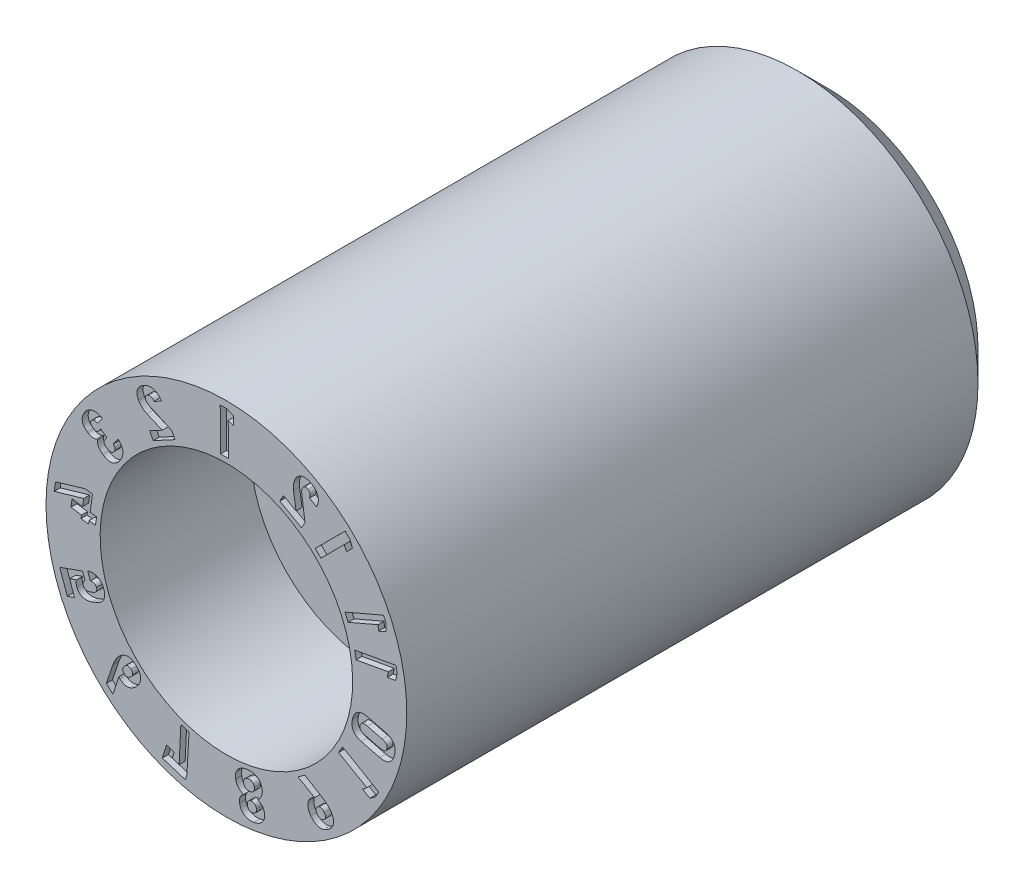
from build123d import *

# Parameters (mm, degrees)
CUT_EXTRUDE1_DEPTH = 0.1


with BuildPart() as part:
    # Sketch1 → Revolve1 (revolve)
    with BuildSketch(Plane(origin=(0, 0, 0), x_dir=(0, 0, -1), z_dir=(1, 0, 0)), mode=Mode.PRIVATE) as revolve1_sk:
        Polygon((10, 0.8), (10, 2.5), (9.5, 3), (0, 3), (0, 2.1), (2.5, 2.1), (2.5, 0.8), align=None)
    revolve(revolve1_sk.sketch.rotate(Axis((0, 0, 0), (0, 0, -1)), 180), axis=Axis((0, 0, 0), (0, 0, -1)))

    # Sketch2 → Cut-Extrude1 (cut)
    # profile 1 of 15: a face of its own
    with BuildSketch(Plane.XY):
        Polygon((-0.098720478, 2.183361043), (0.033456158, 2.18410041), (0.030635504, 2.730707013), (0.116357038, 2.698664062), (0.115654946, 2.839287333), (0.010584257, 2.885948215), (-0.102281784, 2.885328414), align=None)
    # profile 2 of 15: a face of its own
    with BuildSketch(Plane.XY):
        with BuildLine():
            Line((-0.909098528, 2.115845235), (-1.270014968, 2.279834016))
            add(Edge.make_bspline(
                [(-1.270014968, 2.279834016), (-1.285183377, 2.286827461), (-1.303513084, 2.297164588), (-1.321424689, 2.313703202), (-1.331285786, 2.324078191), (-1.337237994, 2.332679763), (-1.34046237, 2.338587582)],
                knots=[0, 0, 0, 0, 0.540031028, 0.66553244, 0.783527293, 1, 1, 1, 1], degree=3))
            add(Edge.make_bspline(
                [(-1.34046237, 2.338587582), (-1.345191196, 2.346859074), (-1.349282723, 2.358912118), (-1.349080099, 2.375373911), (-1.34593905, 2.38686971), (-1.340065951, 2.397752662), (-1.328125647, 2.411955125), (-1.315859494, 2.419934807), (-1.307070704, 2.424732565)],
                knots=[0, 0, 0, 0, 0.246786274, 0.356909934, 0.46944845, 0.586307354, 0.710253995, 1, 1, 1, 1], degree=3))
            add(Edge.make_bspline(
                [(-1.307070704, 2.424732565), (-1.298254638, 2.429437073), (-1.283992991, 2.434470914), (-1.264274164, 2.434539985), (-1.250034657, 2.431328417), (-1.236301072, 2.425121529), (-1.217968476, 2.412442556), (-1.206702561, 2.399086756), (-1.199905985, 2.389271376)],
                knots=[0, 0, 0, 0, 0.240300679, 0.353786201, 0.468512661, 0.587496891, 0.71289196, 1, 1, 1, 1], degree=3))
            Line((-1.199905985, 2.389271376), (-1.080740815, 2.452863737))
            add(Edge.make_bspline(
                [(-1.080740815, 2.452863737), (-1.091852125, 2.470709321), (-1.110121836, 2.494775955), (-1.13894901, 2.521479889), (-1.161443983, 2.537524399), (-1.185017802, 2.550216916), (-1.209502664, 2.559421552), (-1.234868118, 2.56462525), (-1.260823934, 2.566464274), (-1.287247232, 2.564674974), (-1.323430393, 2.556885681), (-1.349667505, 2.546235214), (-1.366473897, 2.53703459)],
                knots=[0, 0, 0, 0, 0.185247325, 0.270908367, 0.35379884, 0.433963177, 0.511943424, 0.589014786, 0.666847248, 0.746166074, 0.827198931, 1, 1, 1, 1], degree=3))
            add(Edge.make_bspline(
                [(-1.366473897, 2.53703459), (-1.384304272, 2.527354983), (-1.409307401, 2.511340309), (-1.437802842, 2.485684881), (-1.454939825, 2.465742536), (-1.468681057, 2.444841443), (-1.478807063, 2.422955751), (-1.485462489, 2.400219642), (-1.488089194, 2.376638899), (-1.487354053, 2.352479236), (-1.480773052, 2.318756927), (-1.470657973, 2.294302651), (-1.462098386, 2.278504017)],
                knots=[0, 0, 0, 0, 0.194582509, 0.283014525, 0.366623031, 0.445927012, 0.521986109, 0.596944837, 0.671952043, 0.748457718, 0.827747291, 1, 1, 1, 1], degree=3))
            add(Edge.make_bspline(
                [(-1.462098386, 2.278504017), (-1.454227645, 2.264109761), (-1.441177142, 2.243880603), (-1.420009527, 2.219623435), (-1.402682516, 2.202363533), (-1.383956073, 2.186555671), (-1.35741098, 2.168042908), (-1.336191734, 2.156382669), (-1.321424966, 2.150036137)],
                knots=[0, 0, 0, 0, 0.24663637, 0.371530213, 0.498650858, 0.625608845, 0.751024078, 1, 1, 1, 1], degree=3))
            Line((-1.321424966, 2.150036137), (-1.066700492, 2.040346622))
            Line((-1.066700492, 2.040346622), (-1.277167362, 1.926913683))
            Line((-1.277167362, 1.926913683), (-1.216935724, 1.815090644))
            Line((-1.216935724, 1.815090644), (-0.852820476, 2.011242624))
            Line((-0.852820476, 2.011242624), (-0.909098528, 2.115845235))
        make_face()
    # profile 3 of 15: a face of its own
    with BuildSketch(Plane.XY):
        with BuildLine():
            Line((-1.801883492, 1.544980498), (-1.880006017, 1.43385943))
            add(Edge.make_bspline(
                [(-1.880006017, 1.43385943), (-1.87487862, 1.429308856), (-1.868086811, 1.421837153), (-1.860996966, 1.410811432), (-1.856895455, 1.402559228), (-1.854247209, 1.3940888), (-1.85252689, 1.38557761), (-1.852072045, 1.37699943), (-1.852601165, 1.368357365), (-1.854488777, 1.359803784), (-1.8583708, 1.348138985), (-1.863371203, 1.340103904), (-1.866839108, 1.334788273)],
                knots=[0, 0, 0, 0, 0.185947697, 0.272003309, 0.355057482, 0.435080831, 0.512072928, 0.590042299, 0.667454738, 0.746220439, 0.82700958, 1, 1, 1, 1], degree=3))
            add(Edge.make_bspline(
                [(-1.866839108, 1.334788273), (-1.873178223, 1.325537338), (-1.884411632, 1.313429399), (-1.902828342, 1.302947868), (-1.917078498, 1.298987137), (-1.931923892, 1.298289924), (-1.953029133, 1.302259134), (-1.967701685, 1.310347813), (-1.97703908, 1.31673151)],
                knots=[0, 0, 0, 0, 0.265501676, 0.382853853, 0.496663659, 0.611874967, 0.731229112, 1, 1, 1, 1], degree=3))
            Line((-1.97703908, 1.31673151), (-1.990372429, 1.326052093))
            add(Edge.make_bspline(
                [(-1.990372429, 1.326052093), (-1.999848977, 1.333083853), (-2.013496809, 1.343714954), (-2.025737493, 1.361652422), (-2.031598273, 1.374526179), (-2.034274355, 1.387715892), (-2.032931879, 1.405850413), (-2.027186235, 1.418607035), (-2.021608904, 1.426083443)],
                knots=[0, 0, 0, 0, 0.300615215, 0.428560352, 0.545417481, 0.656048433, 0.764757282, 1, 1, 1, 1], degree=3))
            Line((-2.021608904, 1.426083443), (-1.987644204, 1.474290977))
            Line((-1.987644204, 1.474290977), (-2.091297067, 1.547206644))
            Line((-2.091297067, 1.547206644), (-2.125261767, 1.498999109))
            add(Edge.make_bspline(
                [(-2.125261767, 1.498999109), (-2.129461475, 1.49262222), (-2.137924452, 1.484861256), (-2.151872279, 1.479097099), (-2.163256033, 1.47786373), (-2.175428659, 1.478828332), (-2.193267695, 1.484488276), (-2.206151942, 1.491513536), (-2.214435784, 1.497553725)],
                knots=[0, 0, 0, 0, 0.226652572, 0.333129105, 0.444988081, 0.564971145, 0.694921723, 1, 1, 1, 1], degree=3))
            Line((-2.214435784, 1.497553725), (-2.224150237, 1.504381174))
            add(Edge.make_bspline(
                [(-2.224150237, 1.504381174), (-2.231925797, 1.509976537), (-2.242700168, 1.519001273), (-2.252270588, 1.534005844), (-2.256502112, 1.545122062), (-2.257906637, 1.556563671), (-2.256464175, 1.572471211), (-2.250509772, 1.583455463), (-2.245918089, 1.590224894)],
                knots=[0, 0, 0, 0, 0.287811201, 0.411477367, 0.527914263, 0.639876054, 0.752930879, 1, 1, 1, 1], degree=3))
            add(Edge.make_bspline(
                [(-2.245918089, 1.590224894), (-2.242607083, 1.594914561), (-2.236845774, 1.6014217), (-2.227352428, 1.607787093), (-2.219822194, 1.611738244), (-2.211638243, 1.614680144), (-2.202886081, 1.616398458), (-2.193590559, 1.617056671), (-2.18386769, 1.616803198), (-2.173733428, 1.615322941), (-2.15932377, 1.611916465), (-2.148708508, 1.607590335), (-2.14158886, 1.604363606)],
                knots=[0, 0, 0, 0, 0.150181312, 0.223296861, 0.297155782, 0.371585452, 0.449302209, 0.52905163, 0.614285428, 0.702508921, 0.795752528, 1, 1, 1, 1], degree=3))
            Line((-2.14158886, 1.604363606), (-2.063773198, 1.715071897))
            add(Edge.make_bspline(
                [(-2.063773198, 1.715071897), (-2.081248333, 1.725217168), (-2.108368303, 1.737622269), (-2.14599919, 1.747445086), (-2.173334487, 1.750835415), (-2.200112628, 1.750925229), (-2.226050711, 1.747485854), (-2.250939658, 1.740533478), (-2.274718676, 1.730366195), (-2.297037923, 1.716989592), (-2.325229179, 1.695251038), (-2.342768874, 1.674601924), (-2.353244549, 1.659856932)],
                knots=[0, 0, 0, 0, 0.185487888, 0.271925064, 0.356056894, 0.437650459, 0.51709444, 0.595429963, 0.674142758, 0.753752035, 0.833670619, 1, 1, 1, 1], degree=3))
            add(Edge.make_bspline(
                [(-2.353244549, 1.659856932), (-2.361796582, 1.64799191), (-2.372736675, 1.629611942), (-2.384516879, 1.60441102), (-2.391052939, 1.586165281), (-2.395609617, 1.568116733), (-2.398086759, 1.550254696), (-2.39865307, 1.532640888), (-2.397130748, 1.515325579), (-2.39392962, 1.498396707), (-2.388440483, 1.482094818), (-2.381277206, 1.466266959), (-2.37218256, 1.450999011), (-2.360976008, 1.436445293), (-2.342960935, 1.417467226), (-2.32760687, 1.404478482), (-2.316246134, 1.39674606)],
                knots=[0, 0, 0, 0, 0.145024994, 0.211773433, 0.275829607, 0.33708983, 0.396197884, 0.454480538, 0.511605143, 0.568407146, 0.625059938, 0.681891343, 0.740573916, 0.801023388, 0.86380105, 1, 1, 1, 1], degree=3))
            Line((-2.316246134, 1.39674606), (-2.299015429, 1.384577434))
            add(Edge.make_bspline(
                [(-2.299015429, 1.384577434), (-2.286442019, 1.376020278), (-2.266469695, 1.364783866), (-2.237435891, 1.357699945), (-2.215827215, 1.355422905), (-2.194139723, 1.35676088), (-2.165045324, 1.363515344), (-2.144565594, 1.373609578), (-2.131738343, 1.381993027)],
                knots=[0, 0, 0, 0, 0.256766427, 0.378902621, 0.5000938, 0.620743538, 0.742279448, 1, 1, 1, 1], degree=3))
            add(Edge.make_bspline(
                [(-2.131738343, 1.381993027), (-2.135009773, 1.374313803), (-2.138503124, 1.362462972), (-2.141321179, 1.346437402), (-2.142113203, 1.334574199), (-2.141599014, 1.3227474), (-2.140234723, 1.310947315), (-2.13730727, 1.299279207), (-2.132195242, 1.283644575), (-2.122651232, 1.264537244), (-2.100992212, 1.234755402), (-2.079355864, 1.215986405), (-2.063356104, 1.204800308)],
                knots=[0, 0, 0, 0, 0.120941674, 0.178737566, 0.235932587, 0.293131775, 0.35041005, 0.40804081, 0.467422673, 0.589011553, 0.716165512, 1, 1, 1, 1], degree=3))
            Line((-2.063356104, 1.204800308), (-2.045991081, 1.192679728))
            add(Edge.make_bspline(
                [(-2.045991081, 1.192679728), (-2.030330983, 1.182031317), (-2.006328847, 1.167678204), (-1.971978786, 1.156440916), (-1.947194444, 1.151756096), (-1.922643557, 1.151045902), (-1.898606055, 1.154169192), (-1.875036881, 1.160844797), (-1.852264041, 1.1716141), (-1.830145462, 1.185815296), (-1.801006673, 1.210402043), (-1.782348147, 1.233301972), (-1.770636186, 1.249662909)],
                knots=[0, 0, 0, 0, 0.178299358, 0.259714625, 0.338098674, 0.414262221, 0.489195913, 0.564778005, 0.643203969, 0.72472314, 0.810857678, 1, 1, 1, 1], degree=3))
            add(Edge.make_bspline(
                [(-1.770636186, 1.249662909), (-1.759102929, 1.266092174), (-1.74414016, 1.291714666), (-1.730625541, 1.327993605), (-1.723986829, 1.354740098), (-1.721156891, 1.381433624), (-1.721493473, 1.407775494), (-1.725987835, 1.433510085), (-1.733635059, 1.458646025), (-1.74515969, 1.482723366), (-1.766077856, 1.513511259), (-1.786625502, 1.533300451), (-1.801883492, 1.544980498)],
                knots=[0, 0, 0, 0, 0.181472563, 0.266227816, 0.349030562, 0.429720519, 0.508099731, 0.586210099, 0.664894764, 0.744781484, 0.826358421, 1, 1, 1, 1], degree=3))
        make_face()
    # profile 4 of 15: a face of its own
    with BuildSketch(Plane.XY):
        Polygon((-2.346366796, 0.556911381), (-2.843020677, 0.40892151), (-2.863791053, 0.261124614), (-2.373786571, 0.404048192), (-2.391588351, 0.277639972), (-2.56712748, 0.302390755), (-2.585641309, 0.171756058), (-2.409987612, 0.14698912), (-2.417640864, 0.092644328), (-2.291825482, 0.074920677), (-2.284166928, 0.129248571), (-2.177397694, 0.114194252), (-2.158883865, 0.244828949), (-2.265749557, 0.259896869), (-2.226272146, 0.539939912), align=None)
    # profile 5 of 15: a face of its own
    with BuildSketch(Plane.XY):
        with BuildLine():
            Line((-2.307233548, -0.60438587), (-2.263150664, -0.729175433))
            add(Edge.make_bspline(
                [(-2.263150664, -0.729175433), (-2.251377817, -0.726141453), (-2.234344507, -0.723644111), (-2.212524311, -0.726198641), (-2.198187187, -0.730522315), (-2.185600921, -0.737514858), (-2.170980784, -0.750226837), (-2.163998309, -0.763355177), (-2.160560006, -0.772475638)],
                knots=[0, 0, 0, 0, 0.285979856, 0.41291731, 0.532388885, 0.648288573, 0.760985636, 1, 1, 1, 1], degree=3))
            add(Edge.make_bspline(
                [(-2.160560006, -0.772475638), (-2.157176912, -0.782326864), (-2.153751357, -0.797843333), (-2.157623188, -0.817807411), (-2.163482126, -0.831313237), (-2.172841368, -0.8434212), (-2.189938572, -0.858644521), (-2.206436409, -0.866138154), (-2.217988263, -0.870396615)],
                knots=[0, 0, 0, 0, 0.245537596, 0.357255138, 0.469313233, 0.585744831, 0.711147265, 1, 1, 1, 1], degree=3))
            Line((-2.217988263, -0.870396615), (-2.273510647, -0.890140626))
            add(Edge.make_bspline(
                [(-2.273510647, -0.890140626), (-2.285083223, -0.894275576), (-2.302260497, -0.898817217), (-2.324790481, -0.898989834), (-2.339182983, -0.896006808), (-2.351935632, -0.890541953), (-2.36642434, -0.879038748), (-2.37356739, -0.866792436), (-2.376612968, -0.857940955)],
                knots=[0, 0, 0, 0, 0.302844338, 0.431574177, 0.550434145, 0.661796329, 0.76957872, 1, 1, 1, 1], degree=3))
            add(Edge.make_bspline(
                [(-2.376612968, -0.857940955), (-2.379604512, -0.849558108), (-2.382537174, -0.836648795), (-2.382109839, -0.819389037), (-2.379664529, -0.807255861), (-2.375219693, -0.795769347), (-2.366577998, -0.781415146), (-2.357286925, -0.772584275), (-2.350456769, -0.767510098)],
                knots=[0, 0, 0, 0, 0.263342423, 0.385862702, 0.507647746, 0.627191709, 0.748065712, 1, 1, 1, 1], degree=3))
            Line((-2.350456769, -0.767510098), (-2.392047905, -0.651183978))
            Line((-2.392047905, -0.651183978), (-2.772130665, -0.786810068))
            Line((-2.772130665, -0.786810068), (-2.645335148, -1.141872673))
            Line((-2.645335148, -1.141872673), (-2.525233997, -1.099040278))
            Line((-2.525233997, -1.099040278), (-2.607524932, -0.868607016))
            Line((-2.607524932, -0.868607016), (-2.490777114, -0.82685566))
            add(Edge.make_bspline(
                [(-2.490777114, -0.82685566), (-2.49394469, -0.833524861), (-2.496743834, -0.844617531), (-2.498627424, -0.860252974), (-2.498859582, -0.886118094), (-2.494910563, -0.907827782), (-2.489257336, -0.924336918)],
                knots=[0, 0, 0, 0, 0.221259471, 0.34293735, 0.47419753, 1, 1, 1, 1], degree=3))
            add(Edge.make_bspline(
                [(-2.489257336, -0.924336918), (-2.483531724, -0.940369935), (-2.472446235, -0.962972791), (-2.452020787, -0.988595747), (-2.434556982, -1.004133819), (-2.415160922, -1.016893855), (-2.393590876, -1.026325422), (-2.37008561, -1.032336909), (-2.344788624, -1.035395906), (-2.317831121, -1.034945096), (-2.278429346, -1.03055616), (-2.248901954, -1.021685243), (-2.229006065, -1.014769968)],
                knots=[0, 0, 0, 0, 0.16365674, 0.239510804, 0.313508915, 0.387354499, 0.46174098, 0.538606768, 0.619722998, 0.705857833, 0.797118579, 1, 1, 1, 1], degree=3))
            Line((-2.229006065, -1.014769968), (-2.173483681, -0.995025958))
            add(Edge.make_bspline(
                [(-2.173483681, -0.995025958), (-2.15357459, -0.987921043), (-2.125327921, -0.975129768), (-2.092397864, -0.95226371), (-2.071928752, -0.933559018), (-2.054870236, -0.913083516), (-2.041499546, -0.890801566), (-2.031828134, -0.866841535), (-2.025784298, -0.841336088), (-2.023691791, -0.814434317), (-2.025934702, -0.775754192), (-2.033564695, -0.746761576), (-2.040346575, -0.727525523)],
                knots=[0, 0, 0, 0, 0.186939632, 0.272046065, 0.353268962, 0.431220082, 0.506711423, 0.581925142, 0.658650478, 0.737395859, 0.819503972, 1, 1, 1, 1], degree=3))
            add(Edge.make_bspline(
                [(-2.040346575, -0.727525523), (-2.046188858, -0.710429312), (-2.058159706, -0.686374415), (-2.079354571, -0.658084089), (-2.097480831, -0.639744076), (-2.117791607, -0.624016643), (-2.140312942, -0.611682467), (-2.16453337, -0.601967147), (-2.190652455, -0.595682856), (-2.21827195, -0.592599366), (-2.257699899, -0.59324521), (-2.287470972, -0.598758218), (-2.307233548, -0.60438587)],
                knots=[0, 0, 0, 0, 0.165351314, 0.244287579, 0.323078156, 0.400981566, 0.478830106, 0.557643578, 0.63948441, 0.724229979, 0.811685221, 1, 1, 1, 1], degree=3))
        make_face()
    # profile 6 of 15: a face of its own
    with BuildSketch(Plane.XY):
        with BuildLine():
            Line((-1.889555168, -1.75439237), (-1.995138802, -2.070022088))
            Line((-1.995138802, -2.070022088), (-1.887249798, -2.173115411))
            Line((-1.887249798, -2.173115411), (-1.789330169, -1.87100414))
            add(Edge.make_bspline(
                [(-1.789330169, -1.87100414), (-1.784440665, -1.877950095), (-1.778712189, -1.884315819), (-1.772623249, -1.890207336)],
                knots=[0.75991926, 0.75991926, 0.75991926, 0.75991926, 1, 1, 1, 1], degree=3))
            add(Edge.make_bspline(
                [(-1.772623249, -1.890207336), (-1.759601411, -1.902634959), (-1.738724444, -1.919069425), (-1.707734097, -1.933968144), (-1.684626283, -1.941262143), (-1.661036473, -1.944568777), (-1.637190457, -1.944477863), (-1.613290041, -1.940185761), (-1.589307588, -1.932493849), (-1.565541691, -1.920949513), (-1.532847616, -1.900391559), (-1.510793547, -1.880080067), (-1.496572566, -1.865343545)],
                knots=[0, 0, 0, 0, 0.171910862, 0.250610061, 0.326760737, 0.401984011, 0.476838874, 0.553147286, 0.632553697, 0.716253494, 0.804371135, 1, 1, 1, 1], degree=3))
            add(Edge.make_bspline(
                [(-1.496572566, -1.865343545), (-1.481622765, -1.85014492), (-1.462532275, -1.826047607), (-1.443272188, -1.791218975), (-1.433401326, -1.765533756), (-1.427161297, -1.739773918), (-1.425382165, -1.714036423), (-1.427328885, -1.688497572), (-1.433460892, -1.663326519), (-1.443364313, -1.638550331), (-1.4626649, -1.605456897), (-1.482096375, -1.583135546), (-1.496638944, -1.569183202)],
                knots=[0, 0, 0, 0, 0.187278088, 0.272506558, 0.353965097, 0.431955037, 0.507955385, 0.583051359, 0.659476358, 0.73805999, 0.820178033, 1, 1, 1, 1], degree=3))
            add(Edge.make_bspline(
                [(-1.496638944, -1.569183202), (-1.511075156, -1.555256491), (-1.534215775, -1.536912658), (-1.568088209, -1.519190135), (-1.593219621, -1.510142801), (-1.618595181, -1.505262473), (-1.644013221, -1.504199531), (-1.669414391, -1.507091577), (-1.694714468, -1.514027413), (-1.719586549, -1.52507634), (-1.753399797, -1.545202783), (-1.775894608, -1.565796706), (-1.790432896, -1.580566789)],
                knots=[0, 0, 0, 0, 0.180176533, 0.262990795, 0.342264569, 0.419092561, 0.494073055, 0.569806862, 0.647689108, 0.728633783, 0.813435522, 1, 1, 1, 1], degree=3))
            add(Edge.make_bspline(
                [(-1.790432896, -1.580566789), (-1.799795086, -1.590255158), (-1.81256956, -1.605552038), (-1.828327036, -1.627489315), (-1.851803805, -1.664362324), (-1.867935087, -1.697687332), (-1.878868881, -1.72535116)],
                knots=[0, 0, 0, 0, 0.23012337, 0.350638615, 0.475698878, 1, 1, 1, 1], degree=3))
            add(Edge.make_bspline(
                [(-1.878868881, -1.72535116), (-1.880807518, -1.730188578), (-1.884872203, -1.73968918), (-1.887855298, -1.74958136), (-1.889555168, -1.75439237)],
                knots=[0, 0, 0, 0, 0.505360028, 1, 1, 1, 1], degree=3))
        make_face()
        with BuildLine():
            add(Edge.make_bspline(
                [(-1.58446489, -1.660961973), (-1.576878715, -1.668197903), (-1.566966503, -1.68030344), (-1.560358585, -1.699200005), (-1.559032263, -1.71322572), (-1.5608835, -1.727359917), (-1.568083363, -1.746977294), (-1.57800407, -1.759998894), (-1.585782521, -1.767977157)],
                knots=[0, 0, 0, 0, 0.259879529, 0.375972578, 0.488654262, 0.604088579, 0.724463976, 1, 1, 1, 1], degree=3))
            add(Edge.make_bspline(
                [(-1.585782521, -1.767977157), (-1.595125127, -1.777630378), (-1.609077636, -1.790168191), (-1.630525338, -1.800199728), (-1.645643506, -1.804116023), (-1.660631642, -1.804200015), (-1.680571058, -1.799470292), (-1.693597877, -1.790304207), (-1.701198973, -1.783031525)],
                knots=[0, 0, 0, 0, 0.29446835, 0.419975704, 0.537202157, 0.647939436, 0.758506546, 1, 1, 1, 1], degree=3))
            add(Edge.make_bspline(
                [(-1.701198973, -1.783031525), (-1.708832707, -1.775869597), (-1.718397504, -1.763222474), (-1.723721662, -1.74342167), (-1.724048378, -1.728380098), (-1.720882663, -1.712957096), (-1.711445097, -1.691271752), (-1.700070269, -1.676542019), (-1.691133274, -1.667339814)],
                knots=[0, 0, 0, 0, 0.240160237, 0.350244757, 0.463156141, 0.580574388, 0.706813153, 1, 1, 1, 1], degree=3))
            add(Edge.make_bspline(
                [(-1.691133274, -1.667339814), (-1.683151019, -1.65896935), (-1.670579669, -1.648595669), (-1.651426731, -1.640334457), (-1.637402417, -1.637996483), (-1.623400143, -1.638720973), (-1.604500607, -1.644815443), (-1.591924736, -1.653657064), (-1.58446489, -1.660961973)],
                knots=[0, 0, 0, 0, 0.277061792, 0.397428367, 0.512562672, 0.626259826, 0.74139413, 1, 1, 1, 1], degree=3))
        make_face(mode=Mode.SUBTRACT)
    # profile 7 of 15: a face of its own
    with BuildSketch(Plane.XY):
        Polygon((-0.656910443, -2.717648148), (-0.621111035, -2.085762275), (-0.75755319, -2.042458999), (-0.785917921, -2.635211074), (-0.900624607, -2.598733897), (-0.86869984, -2.498108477), (-0.99463076, -2.458228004), (-1.065078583, -2.68015205), (-0.683448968, -2.801286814), align=None)
    # profile 8 of 15: a face of its own
    with BuildSketch(Plane.XY):
        with BuildLine():
            Line((0.15402425, -2.365748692), (0.155823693, -2.37716977))
            add(Edge.make_bspline(
                [(0.155823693, -2.37716977), (0.158453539, -2.394221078), (0.166390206, -2.419117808), (0.183362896, -2.449647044), (0.199706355, -2.470633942), (0.218346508, -2.489709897), (0.24660379, -2.510888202), (0.270589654, -2.522167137), (0.287386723, -2.527201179)],
                knots=[0, 0, 0, 0, 0.245950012, 0.369874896, 0.49730233, 0.62492344, 0.749887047, 1, 1, 1, 1], degree=3))
            add(Edge.make_bspline(
                [(0.287386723, -2.527201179), (0.275169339, -2.535813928), (0.258421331, -2.550942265), (0.24088397, -2.57516334), (0.230320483, -2.59475192), (0.222467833, -2.615250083), (0.216226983, -2.643095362), (0.216427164, -2.664453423), (0.218695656, -2.678293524)],
                knots=[0, 0, 0, 0, 0.25672613, 0.38363542, 0.511859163, 0.637851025, 0.759401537, 1, 1, 1, 1], degree=3))
            Line((0.218695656, -2.678293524), (0.221503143, -2.696440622))
            add(Edge.make_bspline(
                [(0.221503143, -2.696440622), (0.224278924, -2.713608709), (0.231279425, -2.738573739), (0.247242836, -2.768530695), (0.261878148, -2.788315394), (0.279135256, -2.805586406), (0.298863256, -2.820003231), (0.32062779, -2.8320291), (0.344740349, -2.840837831), (0.370584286, -2.846983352), (0.408079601, -2.850520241), (0.436893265, -2.848962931), (0.456239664, -2.845616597)],
                knots=[0, 0, 0, 0, 0.166884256, 0.246053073, 0.324355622, 0.40205567, 0.479238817, 0.557958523, 0.639715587, 0.724648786, 0.812018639, 1, 1, 1, 1], degree=3))
            add(Edge.make_bspline(
                [(0.456239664, -2.845616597), (0.475525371, -2.842319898), (0.503706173, -2.835589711), (0.537940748, -2.819980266), (0.560646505, -2.806272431), (0.580639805, -2.790269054), (0.59786071, -2.772215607), (0.611943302, -2.752178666), (0.623007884, -2.730384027), (0.630630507, -2.70707225), (0.636695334, -2.673707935), (0.635251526, -2.647799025), (0.632621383, -2.630622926)],
                knots=[0, 0, 0, 0, 0.188034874, 0.275676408, 0.359981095, 0.44181779, 0.520591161, 0.598494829, 0.675898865, 0.754168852, 0.832942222, 1, 1, 1, 1], degree=3))
            Line((0.632621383, -2.630622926), (0.629813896, -2.612475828))
            add(Edge.make_bspline(
                [(0.629813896, -2.612475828), (0.627769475, -2.598359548), (0.620924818, -2.57788996), (0.606156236, -2.553103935), (0.591974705, -2.536206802), (0.575611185, -2.521081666), (0.551316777, -2.503552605), (0.530315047, -2.494976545), (0.515945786, -2.490716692)],
                knots=[0, 0, 0, 0, 0.24262632, 0.364099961, 0.490538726, 0.617681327, 0.743637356, 1, 1, 1, 1], degree=3))
            add(Edge.make_bspline(
                [(0.515945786, -2.490716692), (0.530641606, -2.480685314), (0.549823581, -2.462084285), (0.570484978, -2.433114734), (0.582496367, -2.409215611), (0.591552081, -2.384178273), (0.598755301, -2.349993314), (0.598259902, -2.323789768), (0.595472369, -2.3067857)],
                knots=[0, 0, 0, 0, 0.252226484, 0.37699801, 0.504744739, 0.631563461, 0.754934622, 1, 1, 1, 1], degree=3))
            Line((0.595472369, -2.3067857), (0.593672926, -2.295364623))
            add(Edge.make_bspline(
                [(0.593672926, -2.295364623), (0.590963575, -2.277042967), (0.583289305, -2.250618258), (0.566399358, -2.218825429), (0.550750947, -2.19797344), (0.532340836, -2.17976148), (0.511566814, -2.16404827), (0.487937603, -2.15194478), (0.462308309, -2.14242158), (0.434622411, -2.136277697), (0.39457444, -2.132061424), (0.363678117, -2.134461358), (0.342958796, -2.13777292)],
                knots=[0, 0, 0, 0, 0.166554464, 0.245225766, 0.322916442, 0.40024906, 0.47767046, 0.556368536, 0.638319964, 0.723174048, 0.810916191, 1, 1, 1, 1], degree=3))
            add(Edge.make_bspline(
                [(0.342958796, -2.13777292), (0.322326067, -2.141328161), (0.29210764, -2.148312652), (0.25547311, -2.165005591), (0.231139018, -2.179474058), (0.209747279, -2.196473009), (0.191222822, -2.21541458), (0.176173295, -2.236711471), (0.164358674, -2.259825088), (0.156016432, -2.284546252), (0.149964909, -2.320023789), (0.150942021, -2.347472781), (0.15402425, -2.365748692)],
                knots=[0, 0, 0, 0, 0.188976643, 0.276820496, 0.361568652, 0.443246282, 0.522147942, 0.59929835, 0.677100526, 0.755105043, 0.833250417, 1, 1, 1, 1], degree=3))
        make_face()
        with BuildLine():
            Line((0.466058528, -2.335179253), (0.467066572, -2.341905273))
            add(Edge.make_bspline(
                [(0.467066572, -2.341905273), (0.468120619, -2.349299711), (0.468826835, -2.360486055), (0.466156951, -2.37490175), (0.462672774, -2.384919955), (0.457802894, -2.394244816), (0.451792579, -2.402921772), (0.444251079, -2.410644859), (0.435572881, -2.417546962), (0.425746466, -2.423440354), (0.410957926, -2.43019933), (0.398770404, -2.433062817), (0.390421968, -2.434498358)],
                knots=[0, 0, 0, 0, 0.166389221, 0.245774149, 0.32412705, 0.401036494, 0.47875356, 0.557638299, 0.639825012, 0.724352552, 0.811459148, 1, 1, 1, 1], degree=3))
            add(Edge.make_bspline(
                [(0.390421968, -2.434498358), (0.382020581, -2.435720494), (0.369543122, -2.436849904), (0.35332663, -2.435072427), (0.342191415, -2.432482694), (0.331756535, -2.428684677), (0.322386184, -2.423385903), (0.313753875, -2.417173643), (0.306181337, -2.409689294), (0.299739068, -2.4011346), (0.292886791, -2.388157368), (0.289699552, -2.377461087), (0.288617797, -2.370038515)],
                knots=[0, 0, 0, 0, 0.1884736, 0.275197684, 0.360268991, 0.441190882, 0.520184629, 0.597925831, 0.676115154, 0.755045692, 0.834172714, 1, 1, 1, 1], degree=3))
            Line((0.288617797, -2.370038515), (0.287476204, -2.362905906))
            add(Edge.make_bspline(
                [(0.287476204, -2.362905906), (0.286210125, -2.35487403), (0.285686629, -2.342882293), (0.287968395, -2.327291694), (0.291367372, -2.316505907), (0.29597198, -2.306278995), (0.302137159, -2.297095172), (0.309575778, -2.288795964), (0.31826962, -2.281524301), (0.328026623, -2.27507128), (0.342874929, -2.268336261), (0.354808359, -2.264858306), (0.363157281, -2.26372233)],
                knots=[0, 0, 0, 0, 0.173777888, 0.254717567, 0.335682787, 0.414820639, 0.493742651, 0.571176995, 0.652365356, 0.735479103, 0.820480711, 1, 1, 1, 1], degree=3))
            add(Edge.make_bspline(
                [(0.363157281, -2.26372233), (0.371494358, -2.262303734), (0.383969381, -2.261704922), (0.400168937, -2.263725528), (0.411402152, -2.266821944), (0.421876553, -2.271254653), (0.43165422, -2.276686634), (0.440170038, -2.28392407), (0.44783027, -2.292123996), (0.454367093, -2.301504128), (0.4616588, -2.315503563), (0.464805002, -2.327179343), (0.466058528, -2.335179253)],
                knots=[0, 0, 0, 0, 0.18005291, 0.26436873, 0.347011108, 0.427480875, 0.506430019, 0.584318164, 0.664589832, 0.745065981, 0.827209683, 1, 1, 1, 1], degree=3))
        make_face(mode=Mode.SUBTRACT)
        with BuildLine():
            Line((0.498290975, -2.62804849), (0.499299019, -2.634774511))
            add(Edge.make_bspline(
                [(0.499299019, -2.634774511), (0.500263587, -2.641646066), (0.501132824, -2.651958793), (0.498997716, -2.665277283), (0.496369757, -2.6745306), (0.492626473, -2.683269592), (0.487413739, -2.691083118), (0.481331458, -2.698318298), (0.474025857, -2.70454837), (0.465843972, -2.709997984), (0.453358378, -2.715903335), (0.443078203, -2.7184492), (0.43604118, -2.719667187)],
                knots=[0, 0, 0, 0, 0.175248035, 0.257090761, 0.338037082, 0.416806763, 0.495075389, 0.573435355, 0.653849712, 0.735674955, 0.820090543, 1, 1, 1, 1], degree=3))
            add(Edge.make_bspline(
                [(0.43604118, -2.719667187), (0.428998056, -2.720669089), (0.41840988, -2.721682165), (0.404776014, -2.719584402), (0.395237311, -2.717313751), (0.386423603, -2.713462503), (0.37834067, -2.708613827), (0.371019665, -2.702640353), (0.364659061, -2.695495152), (0.359093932, -2.687447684), (0.353345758, -2.675087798), (0.350485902, -2.665116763), (0.349471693, -2.658161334)],
                knots=[0, 0, 0, 0, 0.179111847, 0.262746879, 0.344693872, 0.424028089, 0.502580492, 0.58023367, 0.659692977, 0.741501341, 0.824386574, 1, 1, 1, 1], degree=3))
            Line((0.349471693, -2.658161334), (0.3483301, -2.651028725))
            add(Edge.make_bspline(
                [(0.3483301, -2.651028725), (0.347010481, -2.643822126), (0.346574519, -2.633008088), (0.348124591, -2.61891207), (0.350907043, -2.609129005), (0.354575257, -2.599911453), (0.359484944, -2.591432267), (0.365766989, -2.584008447), (0.372851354, -2.57721879), (0.381088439, -2.571567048), (0.393447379, -2.565246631), (0.403672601, -2.562354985), (0.410752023, -2.561305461)],
                knots=[0, 0, 0, 0, 0.17820891, 0.262813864, 0.344874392, 0.425545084, 0.504461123, 0.582683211, 0.662100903, 0.743229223, 0.825445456, 1, 1, 1, 1], degree=3))
            add(Edge.make_bspline(
                [(0.410752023, -2.561305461), (0.41783279, -2.56003639), (0.428455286, -2.559646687), (0.442196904, -2.56168821), (0.451738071, -2.5645862), (0.460598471, -2.568736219), (0.46877519, -2.574011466), (0.47619028, -2.58043894), (0.482584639, -2.588207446), (0.488158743, -2.596857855), (0.494221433, -2.609984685), (0.497287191, -2.620603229), (0.498290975, -2.62804849)],
                knots=[0, 0, 0, 0, 0.17383815, 0.255176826, 0.335334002, 0.414325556, 0.491269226, 0.570235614, 0.650821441, 0.734020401, 0.818687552, 1, 1, 1, 1], degree=3))
        make_face(mode=Mode.SUBTRACT)
    # profile 9 of 15: a face of its own
    with BuildSketch(Plane.XY):
        with BuildLine():
            Line((1.580014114, -1.910742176), (1.303672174, -1.74211754))
            Line((1.303672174, -1.74211754), (1.191272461, -1.823730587))
            Line((1.191272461, -1.823730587), (1.466692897, -1.985341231))
            add(Edge.make_bspline(
                [(1.466692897, -1.985341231), (1.466036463, -1.985560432), (1.460942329, -1.987306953), (1.446345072, -1.993282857), (1.433660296, -2.001593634), (1.425177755, -2.007488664)],
                knots=[0.563271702, 0.563271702, 0.563271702, 0.563271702, 0.582456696, 0.712545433, 1, 1, 1, 1], degree=3))
            add(Edge.make_bspline(
                [(1.425177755, -2.007488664), (1.411813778, -2.017393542), (1.39329394, -2.034066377), (1.374928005, -2.061004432), (1.364444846, -2.082306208), (1.357498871, -2.104907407), (1.353544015, -2.128363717), (1.353350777, -2.152647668), (1.356359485, -2.177506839), (1.362913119, -2.202608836), (1.375985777, -2.237024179), (1.390863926, -2.261148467), (1.401990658, -2.27674116)],
                knots=[0, 0, 0, 0, 0.164686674, 0.242999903, 0.32077056, 0.398262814, 0.475705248, 0.554875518, 0.637235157, 0.72230948, 0.81046721, 1, 1, 1, 1], degree=3))
            add(Edge.make_bspline(
                [(1.401990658, -2.27674116), (1.414817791, -2.293949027), (1.434594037, -2.317587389), (1.465631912, -2.342429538), (1.488882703, -2.356977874), (1.513084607, -2.367449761), (1.53784871, -2.374063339), (1.563231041, -2.376691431), (1.589043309, -2.37523091), (1.61513957, -2.369752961), (1.651109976, -2.356761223), (1.676594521, -2.341812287), (1.692832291, -2.329914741)],
                knots=[0, 0, 0, 0, 0.187674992, 0.273075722, 0.35439933, 0.43207934, 0.507842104, 0.582607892, 0.659159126, 0.73796091, 0.820071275, 1, 1, 1, 1], degree=3))
            add(Edge.make_bspline(
                [(1.692832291, -2.329914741), (1.709090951, -2.318252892), (1.731162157, -2.298791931), (1.75447012, -2.268620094), (1.767566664, -2.245335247), (1.776688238, -2.220991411), (1.782076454, -2.195851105), (1.783249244, -2.169964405), (1.780656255, -2.143472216), (1.774210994, -2.116485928), (1.759440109, -2.079223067), (1.743754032, -2.052542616), (1.731094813, -2.035566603)],
                knots=[0, 0, 0, 0, 0.17804964, 0.259654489, 0.338129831, 0.414765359, 0.490064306, 0.565893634, 0.644318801, 0.726149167, 0.811832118, 1, 1, 1, 1], degree=3))
            add(Edge.make_bspline(
                [(1.731094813, -2.035566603), (1.723805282, -2.025325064), (1.711618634, -2.011164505), (1.693491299, -1.993298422), (1.678165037, -1.979800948), (1.661550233, -1.966277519), (1.636950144, -1.947911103), (1.61757332, -1.934500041), (1.604071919, -1.92577962)],
                knots=[0, 0, 0, 0, 0.216626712, 0.332172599, 0.453193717, 0.580305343, 0.713713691, 1, 1, 1, 1], degree=3))
            add(Edge.make_bspline(
                [(1.604071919, -1.92577962), (1.600102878, -1.923121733), (1.592090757, -1.918095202), (1.584268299, -1.912753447), (1.580014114, -1.910742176)],
                knots=[0, 0, 0, 0, 0.504712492, 1, 1, 1, 1], degree=3))
        make_face()
        with BuildLine():
            add(Edge.make_bspline(
                [(1.519403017, -2.090839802), (1.527778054, -2.08469599), (1.541643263, -2.077416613), (1.56171989, -2.075222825), (1.576196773, -2.077128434), (1.590441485, -2.082189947), (1.609318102, -2.094466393), (1.621187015, -2.107511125), (1.628215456, -2.117430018)],
                knots=[0, 0, 0, 0, 0.246692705, 0.358778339, 0.471983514, 0.588823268, 0.712749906, 1, 1, 1, 1], degree=3))
            add(Edge.make_bspline(
                [(1.628215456, -2.117430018), (1.635271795, -2.127352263), (1.644120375, -2.142076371), (1.649039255, -2.163333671), (1.649356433, -2.178043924), (1.646414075, -2.192065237), (1.637385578, -2.20986232), (1.626518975, -2.220793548), (1.617959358, -2.226761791)],
                knots=[0, 0, 0, 0, 0.283249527, 0.406264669, 0.522768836, 0.635824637, 0.748302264, 1, 1, 1, 1], degree=3))
            add(Edge.make_bspline(
                [(1.617959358, -2.226761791), (1.609479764, -2.232843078), (1.595675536, -2.240298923), (1.57574012, -2.242932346), (1.561411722, -2.241527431), (1.547468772, -2.236585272), (1.528898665, -2.225010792), (1.517401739, -2.212255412), (1.510562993, -2.20273323)],
                knots=[0, 0, 0, 0, 0.25214523, 0.365991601, 0.478154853, 0.594597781, 0.717792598, 1, 1, 1, 1], degree=3))
            add(Edge.make_bspline(
                [(1.510562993, -2.20273323), (1.503107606, -2.192501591), (1.494287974, -2.177219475), (1.488656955, -2.155494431), (1.488164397, -2.140530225), (1.490857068, -2.126192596), (1.499744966, -2.107980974), (1.510851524, -2.096931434), (1.519403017, -2.090839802)],
                knots=[0, 0, 0, 0, 0.287540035, 0.410630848, 0.526441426, 0.63843737, 0.751687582, 1, 1, 1, 1], degree=3))
        make_face(mode=Mode.SUBTRACT)
    # profile 10 of 15: a face of its own
    with BuildSketch(Plane.XY):
        Polygon((1.931933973, -1.021612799), (1.866147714, -1.135234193), (2.335575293, -1.40724765), (2.265012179, -1.464588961), (2.385768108, -1.534508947), (2.478564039, -1.468052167), (2.534811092, -1.371072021), align=None)
    # profile 11 of 15: a face of its own
    with BuildSketch(Plane.XY):
        with BuildLine():
            Line((2.240299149, -0.786701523), (2.549818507, -0.865178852))
            add(Edge.make_bspline(
                [(2.549818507, -0.865178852), (2.564340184, -0.868673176), (2.585918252, -0.872934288), (2.614465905, -0.87417158), (2.634453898, -0.873178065), (2.653631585, -0.870189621), (2.671923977, -0.865226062), (2.689373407, -0.858246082), (2.705888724, -0.849378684), (2.721377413, -0.838575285), (2.735675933, -0.825860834), (2.748590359, -0.811172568), (2.760533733, -0.794779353), (2.770884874, -0.776305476), (2.783681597, -0.748556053), (2.791047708, -0.726157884), (2.794823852, -0.710490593)],
                knots=[0, 0, 0, 0, 0.13593978, 0.198951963, 0.259288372, 0.317550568, 0.375017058, 0.431183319, 0.488002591, 0.545020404, 0.602438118, 0.661459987, 0.722464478, 0.786441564, 0.853570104, 1, 1, 1, 1], degree=3))
            add(Edge.make_bspline(
                [(2.794823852, -0.710490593), (2.798723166, -0.694803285), (2.80323997, -0.671599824), (2.805308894, -0.641007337), (2.804925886, -0.619777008), (2.802334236, -0.599655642), (2.797920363, -0.58062273), (2.791623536, -0.562629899), (2.783141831, -0.545822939), (2.772792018, -0.530286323), (2.760844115, -0.51587871), (2.747030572, -0.50286521), (2.731504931, -0.491249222), (2.714409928, -0.480787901), (2.68857822, -0.468410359), (2.66757839, -0.461645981), (2.653035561, -0.45788484)],
                knots=[0, 0, 0, 0, 0.146899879, 0.213952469, 0.278179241, 0.339428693, 0.397852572, 0.455344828, 0.512130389, 0.568349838, 0.624567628, 0.681763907, 0.740275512, 0.800381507, 0.863506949, 1, 1, 1, 1], degree=3))
            Line((2.653035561, -0.45788484), (2.343516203, -0.379407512))
            add(Edge.make_bspline(
                [(2.343516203, -0.379407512), (2.328994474, -0.37591305), (2.307416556, -0.371652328), (2.278868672, -0.370414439), (2.258881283, -0.371409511), (2.239768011, -0.374382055), (2.221481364, -0.379354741), (2.204072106, -0.386265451), (2.187591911, -0.395200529), (2.172148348, -0.405950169), (2.157855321, -0.418670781), (2.14492754, -0.43335037), (2.13303386, -0.449774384), (2.122481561, -0.468131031), (2.109694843, -0.495899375), (2.102644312, -0.518396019), (2.098578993, -0.533970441)],
                knots=[0, 0, 0, 0, 0.136024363, 0.199075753, 0.259449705, 0.317748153, 0.374638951, 0.431449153, 0.487705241, 0.544758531, 0.60221197, 0.661270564, 0.722313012, 0.786340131, 0.853510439, 1, 1, 1, 1], degree=3))
            add(Edge.make_bspline(
                [(2.098578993, -0.533970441), (2.094742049, -0.549661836), (2.090044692, -0.572873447), (2.088247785, -0.603462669), (2.088651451, -0.624699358), (2.091402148, -0.644818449), (2.095880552, -0.663905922), (2.102467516, -0.681874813), (2.111020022, -0.698731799), (2.12149057, -0.714347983), (2.133571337, -0.728699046), (2.147140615, -0.741911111), (2.162636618, -0.753453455), (2.179659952, -0.76383129), (2.205155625, -0.776335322), (2.225914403, -0.783098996), (2.240299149, -0.786701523)],
                knots=[0, 0, 0, 0, 0.147108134, 0.214437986, 0.27838103, 0.339971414, 0.398766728, 0.456376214, 0.513598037, 0.570279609, 0.626979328, 0.683952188, 0.742119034, 0.802310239, 0.865073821, 1, 1, 1, 1], degree=3))
        make_face()
        with BuildLine():
            Line((2.343934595, -0.516026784), (2.587762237, -0.577950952))
            add(Edge.make_bspline(
                [(2.587762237, -0.577950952), (2.602355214, -0.58179825), (2.623207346, -0.588392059), (2.646382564, -0.602986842), (2.65758873, -0.61287053), (2.664369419, -0.621692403), (2.668511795, -0.628616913), (2.67137442, -0.63610834), (2.673421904, -0.643921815), (2.67428724, -0.652161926), (2.674359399, -0.664051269), (2.672652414, -0.673102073), (2.671230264, -0.679183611)],
                knots=[0, 0, 0, 0, 0.304307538, 0.432418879, 0.547403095, 0.601641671, 0.655136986, 0.708632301, 0.761957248, 0.816738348, 0.874368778, 1, 1, 1, 1], degree=3))
            add(Edge.make_bspline(
                [(2.671230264, -0.679183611), (2.669723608, -0.685265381), (2.666769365, -0.693960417), (2.661097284, -0.704448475), (2.656318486, -0.711247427), (2.650784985, -0.717102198), (2.644731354, -0.72227279), (2.637889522, -0.726488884), (2.627583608, -0.730884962), (2.613091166, -0.734580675), (2.585668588, -0.735917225), (2.564227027, -0.732408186), (2.549525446, -0.728627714)],
                knots=[0, 0, 0, 0, 0.1256985, 0.182899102, 0.238594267, 0.291776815, 0.344002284, 0.397804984, 0.452153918, 0.56817232, 0.695399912, 1, 1, 1, 1], degree=3))
            Line((2.549525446, -0.728627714), (2.305697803, -0.666703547))
            add(Edge.make_bspline(
                [(2.305697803, -0.666703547), (2.291036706, -0.662870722), (2.270244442, -0.656203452), (2.246988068, -0.641675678), (2.235968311, -0.631648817), (2.229145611, -0.622843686), (2.225071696, -0.615922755), (2.222028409, -0.608533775), (2.22008359, -0.600696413), (2.219001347, -0.59245863), (2.219009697, -0.580530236), (2.220663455, -0.571486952), (2.222104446, -0.565402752)],
                knots=[0, 0, 0, 0, 0.305203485, 0.432340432, 0.54753734, 0.601766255, 0.655252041, 0.708130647, 0.761446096, 0.816770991, 0.874391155, 1, 1, 1, 1], degree=3))
            add(Edge.make_bspline(
                [(2.222104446, -0.565402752), (2.223610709, -0.55932059), (2.22656607, -0.550626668), (2.232236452, -0.540136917), (2.237019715, -0.533342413), (2.242579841, -0.527426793), (2.248714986, -0.522308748), (2.255660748, -0.518173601), (2.265841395, -0.513578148), (2.280424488, -0.510141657), (2.307772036, -0.50867911), (2.329244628, -0.512281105), (2.343934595, -0.516026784)],
                knots=[0, 0, 0, 0, 0.125633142, 0.182804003, 0.238470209, 0.291625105, 0.345061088, 0.398010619, 0.453086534, 0.56839685, 0.69555829, 1, 1, 1, 1], degree=3))
        make_face(mode=Mode.SUBTRACT)
    # profile 12 of 15: a face of its own
    with BuildSketch(Plane.XY):
        Polygon((2.133720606, 0.473362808), (2.157142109, 0.343812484), (2.692207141, 0.440467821), (2.675547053, 0.351195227), (2.813128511, 0.375951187), (2.840861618, 0.486893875), (2.820893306, 0.597476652), align=None)
    # profile 13 of 15: a face of its own
    with BuildSketch(Plane.XY):
        Polygon((1.972649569, 0.940167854), (2.024647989, 0.819229), (2.523861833, 1.034185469), (2.527944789, 0.943578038), (2.656266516, 0.998796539), (2.6583257, 1.113075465), (2.613854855, 1.21624982), align=None)
    # profile 14 of 15: a face of its own
    with BuildSketch(Plane.XY):
        Polygon((1.478173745, 1.609970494), (1.572290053, 1.51621219), (1.959254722, 1.904995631), (1.997264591, 1.821559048), (2.096705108, 1.92140531), (2.055596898, 2.029365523), (1.975233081, 2.109343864), align=None)
    # profile 15 of 15: a face of its own
    with BuildSketch(Plane.XY):
        with BuildLine():
            Line((1.307073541, 1.896302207), (1.253581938, 2.289465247))
            add(Edge.make_bspline(
                [(1.253581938, 2.289465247), (1.251388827, 2.306057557), (1.250327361, 2.327130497), (1.254949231, 2.351078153), (1.258352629, 2.364979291), (1.262689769, 2.374536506), (1.265819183, 2.38050159)],
                knots=[0, 0, 0, 0, 0.540853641, 0.665328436, 0.783095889, 1, 1, 1, 1], degree=3))
            add(Edge.make_bspline(
                [(1.265819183, 2.38050159), (1.270494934, 2.388617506), (1.278280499, 2.39880796), (1.292442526, 2.407358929), (1.303894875, 2.410799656), (1.316310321, 2.41149985), (1.334713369, 2.409110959), (1.3479656, 2.40281353), (1.356726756, 2.398135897)],
                knots=[0, 0, 0, 0, 0.246977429, 0.357638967, 0.470298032, 0.587001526, 0.71246079, 1, 1, 1, 1], degree=3))
            add(Edge.make_bspline(
                [(1.356726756, 2.398135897), (1.365483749, 2.393220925), (1.377420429, 2.383853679), (1.387941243, 2.367120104), (1.39275981, 2.353308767), (1.394831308, 2.338302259), (1.393739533, 2.315902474), (1.38816013, 2.299245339), (1.383441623, 2.288221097)],
                knots=[0, 0, 0, 0, 0.240594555, 0.353002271, 0.467657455, 0.587204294, 0.712514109, 1, 1, 1, 1], degree=3))
            Line((1.383441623, 2.288221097), (1.501107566, 2.221090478))
            add(Edge.make_bspline(
                [(1.501107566, 2.221090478), (1.510213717, 2.240138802), (1.521082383, 2.268467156), (1.5282538, 2.30724135), (1.529850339, 2.33487933), (1.52809932, 2.361668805), (1.522608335, 2.38725339), (1.513794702, 2.411630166), (1.501295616, 2.434509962), (1.485578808, 2.455816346), (1.460165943, 2.482739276), (1.436583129, 2.498591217), (1.420091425, 2.508216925)],
                knots=[0, 0, 0, 0, 0.185811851, 0.271428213, 0.35438374, 0.434677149, 0.512592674, 0.589401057, 0.66746137, 0.746639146, 0.827414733, 1, 1, 1, 1], degree=3))
            add(Edge.make_bspline(
                [(1.420091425, 2.508216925), (1.402373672, 2.518033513), (1.375682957, 2.531194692), (1.338694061, 2.541220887), (1.312752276, 2.545367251), (1.287688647, 2.545866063), (1.263763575, 2.542535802), (1.240944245, 2.536058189), (1.219542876, 2.525754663), (1.19944038, 2.512285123), (1.174502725, 2.488611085), (1.158815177, 2.467322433), (1.150158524, 2.451498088)],
                knots=[0, 0, 0, 0, 0.194491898, 0.282754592, 0.366202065, 0.445570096, 0.521878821, 0.596778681, 0.671826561, 0.748451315, 0.827594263, 1, 1, 1, 1], degree=3))
            add(Edge.make_bspline(
                [(1.150158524, 2.451498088), (1.141925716, 2.437338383), (1.132269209, 2.415293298), (1.122557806, 2.384591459), (1.117350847, 2.360637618), (1.114110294, 2.336326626), (1.112138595, 2.303925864), (1.114034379, 2.279694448), (1.116266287, 2.263771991)],
                knots=[0, 0, 0, 0, 0.246329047, 0.371481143, 0.498035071, 0.625315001, 0.750897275, 1, 1, 1, 1], degree=3))
            Line((1.116266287, 2.263771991), (1.15891876, 1.989554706))
            Line((1.15891876, 1.989554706), (0.950697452, 2.107479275))
            Line((0.950697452, 2.107479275), (0.888017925, 1.996811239))
            Line((0.888017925, 1.996811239), (1.248453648, 1.792729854))
            Line((1.248453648, 1.792729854), (1.307073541, 1.896302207))
        make_face()
    extrude(amount=-CUT_EXTRUDE1_DEPTH, mode=Mode.SUBTRACT)


solid = part.part
